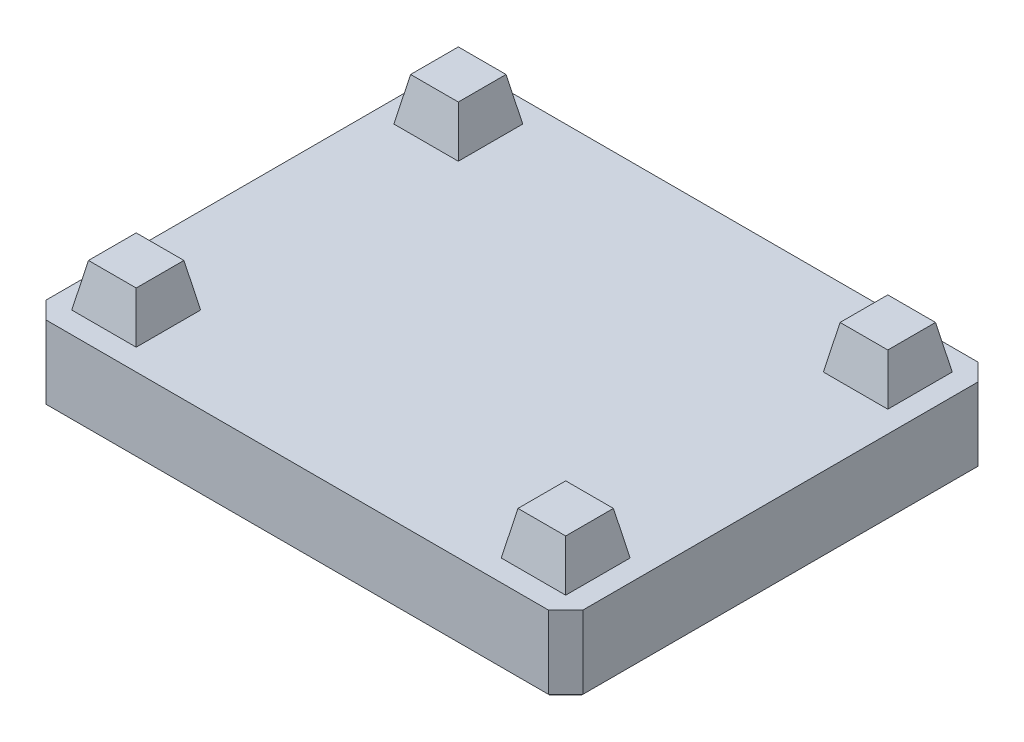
ISO-10303-21;
HEADER;
FILE_DESCRIPTION(('STEP AP214'),'2;1');
FILE_NAME('part.step','',(''),(''),'','','');
FILE_SCHEMA(('AUTOMOTIVE_DESIGN { 1 0 10303 214 1 1 1 1 }'));
ENDSEC;
DATA;
#1=APPLICATION_CONTEXT('core data for automotive mechanical design processes');
#2=APPLICATION_PROTOCOL_DEFINITION('international standard','automotive_design',2000,#1);
#3=PRODUCT_CONTEXT('',#1,'mechanical');
#4=PRODUCT('Part','Part','',(#3));
#5=PRODUCT_RELATED_PRODUCT_CATEGORY('part','',(#4));
#6=PRODUCT_DEFINITION_FORMATION('','',#4);
#7=PRODUCT_DEFINITION_CONTEXT('part definition',#1,'design');
#8=PRODUCT_DEFINITION('design','',#6,#7);
#9=PRODUCT_DEFINITION_SHAPE('','',#8);
#10=(LENGTH_UNIT() NAMED_UNIT(*) SI_UNIT(.MILLI.,.METRE.));
#11=(NAMED_UNIT(*) PLANE_ANGLE_UNIT() SI_UNIT($,.RADIAN.));
#12=(NAMED_UNIT(*) SI_UNIT($,.STERADIAN.) SOLID_ANGLE_UNIT());
#13=UNCERTAINTY_MEASURE_WITH_UNIT(LENGTH_MEASURE(1.E-05),#10,'distance_accuracy_value','');
#14=(GEOMETRIC_REPRESENTATION_CONTEXT(3) GLOBAL_UNCERTAINTY_ASSIGNED_CONTEXT((#13)) GLOBAL_UNIT_ASSIGNED_CONTEXT((#10,
#11,#12)) REPRESENTATION_CONTEXT('',''));
#15=CARTESIAN_POINT('',(0.,0.,0.));
#16=DIRECTION('',(0.,0.,1.));
#17=DIRECTION('',(1.,0.,0.));
#18=AXIS2_PLACEMENT_3D('',#15,#16,#17);
#19=CARTESIAN_POINT('',(0.,35.,200.));
#20=DIRECTION('',(0.,-1.,0.));
#21=DIRECTION('',(0.,0.,-1.));
#22=AXIS2_PLACEMENT_3D('',#19,#20,#21);
#23=PLANE('',#22);
#24=DIRECTION('',(0.,0.,-1.));
#25=VECTOR('',#24,1.);
#26=CARTESIAN_POINT('',(240.,35.,10.));
#27=LINE('',#26,#25);
#28=CARTESIAN_POINT('',(240.,35.,40.));
#29=VERTEX_POINT('',#28);
#30=CARTESIAN_POINT('',(240.,35.,10.));
#31=VERTEX_POINT('',#30);
#32=EDGE_CURVE('E244',#29,#31,#27,.T.);
#33=ORIENTED_EDGE('',*,*,#32,.F.);
#34=DIRECTION('',(1.,0.,0.));
#35=VECTOR('',#34,1.);
#36=CARTESIAN_POINT('',(240.,35.,40.));
#37=LINE('',#36,#35);
#38=CARTESIAN_POINT('',(210.,35.,40.));
#39=VERTEX_POINT('',#38);
#40=EDGE_CURVE('E257',#39,#29,#37,.T.);
#41=ORIENTED_EDGE('',*,*,#40,.F.);
#42=DIRECTION('',(0.,0.,1.));
#43=VECTOR('',#42,1.);
#44=CARTESIAN_POINT('',(210.,35.,10.));
#45=LINE('',#44,#43);
#46=CARTESIAN_POINT('',(210.,35.,9.99999999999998));
#47=VERTEX_POINT('',#46);
#48=EDGE_CURVE('E254',#47,#39,#45,.T.);
#49=ORIENTED_EDGE('',*,*,#48,.F.);
#50=DIRECTION('',(-1.,0.,0.));
#51=VECTOR('',#50,1.);
#52=CARTESIAN_POINT('',(240.,35.,10.));
#53=LINE('',#52,#51);
#54=EDGE_CURVE('E251',#31,#47,#53,.T.);
#55=ORIENTED_EDGE('',*,*,#54,.F.);
#56=EDGE_LOOP('',(#33,#41,#49,#55));
#57=FACE_BOUND('',#56,.T.);
#58=DIRECTION('',(-1.,0.,0.));
#59=VECTOR('',#58,1.);
#60=CARTESIAN_POINT('',(0.,35.,0.));
#61=LINE('',#60,#59);
#62=CARTESIAN_POINT('',(242.,35.,0.));
#63=VERTEX_POINT('',#62);
#64=CARTESIAN_POINT('',(8.00000000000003,35.,0.));
#65=VERTEX_POINT('',#64);
#66=EDGE_CURVE('E303',#63,#65,#61,.T.);
#67=ORIENTED_EDGE('',*,*,#66,.T.);
#68=DIRECTION('',(-0.707106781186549,0.,0.707106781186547));
#69=VECTOR('',#68,1.);
#70=CARTESIAN_POINT('',(0.,35.,8.00000000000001));
#71=LINE('',#70,#69);
#72=CARTESIAN_POINT('',(0.,35.,8.00000000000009));
#73=VERTEX_POINT('',#72);
#74=EDGE_CURVE('E331',#65,#73,#71,.T.);
#75=ORIENTED_EDGE('',*,*,#74,.T.);
#76=DIRECTION('',(0.,0.,-1.));
#77=VECTOR('',#76,1.);
#78=CARTESIAN_POINT('',(0.,35.,200.));
#79=LINE('',#78,#77);
#80=CARTESIAN_POINT('',(0.,35.,192.));
#81=VERTEX_POINT('',#80);
#82=EDGE_CURVE('E309',#81,#73,#79,.T.);
#83=ORIENTED_EDGE('',*,*,#82,.F.);
#84=DIRECTION('',(-0.707106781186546,0.,-0.707106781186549));
#85=VECTOR('',#84,1.);
#86=CARTESIAN_POINT('',(8.00000000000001,35.,200.));
#87=LINE('',#86,#85);
#88=CARTESIAN_POINT('',(8.00000000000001,35.,200.));
#89=VERTEX_POINT('',#88);
#90=EDGE_CURVE('E325',#81,#89,#87,.F.);
#91=ORIENTED_EDGE('',*,*,#90,.T.);
#92=DIRECTION('',(-1.,0.,0.));
#93=VECTOR('',#92,1.);
#94=CARTESIAN_POINT('',(0.,35.,200.));
#95=LINE('',#94,#93);
#96=CARTESIAN_POINT('',(242.,35.,200.));
#97=VERTEX_POINT('',#96);
#98=EDGE_CURVE('E306',#97,#89,#95,.T.);
#99=ORIENTED_EDGE('',*,*,#98,.F.);
#100=DIRECTION('',(-0.707106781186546,0.,0.707106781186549));
#101=VECTOR('',#100,1.);
#102=CARTESIAN_POINT('',(242.,35.,200.));
#103=LINE('',#102,#101);
#104=CARTESIAN_POINT('',(250.,35.,192.));
#105=VERTEX_POINT('',#104);
#106=EDGE_CURVE('E327',#97,#105,#103,.F.);
#107=ORIENTED_EDGE('',*,*,#106,.T.);
#108=DIRECTION('',(0.,0.,-1.));
#109=VECTOR('',#108,1.);
#110=CARTESIAN_POINT('',(250.,35.,200.));
#111=LINE('',#110,#109);
#112=CARTESIAN_POINT('',(250.,35.,8.00000000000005));
#113=VERTEX_POINT('',#112);
#114=EDGE_CURVE('E312',#105,#113,#111,.T.);
#115=ORIENTED_EDGE('',*,*,#114,.T.);
#116=DIRECTION('',(-0.707106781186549,0.,-0.707106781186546));
#117=VECTOR('',#116,1.);
#118=CARTESIAN_POINT('',(250.,35.,8.00000000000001));
#119=LINE('',#118,#117);
#120=EDGE_CURVE('E329',#113,#63,#119,.T.);
#121=ORIENTED_EDGE('',*,*,#120,.T.);
#122=EDGE_LOOP('',(#67,#75,#83,#91,#99,#107,#115,#121));
#123=FACE_BOUND('',#122,.T.);
#124=DIRECTION('',(0.,0.,-1.));
#125=VECTOR('',#124,1.);
#126=CARTESIAN_POINT('',(240.,35.,160.));
#127=LINE('',#126,#125);
#128=CARTESIAN_POINT('',(240.,35.,190.));
#129=VERTEX_POINT('',#128);
#130=CARTESIAN_POINT('',(240.,35.,160.));
#131=VERTEX_POINT('',#130);
#132=EDGE_CURVE('E241',#129,#131,#127,.T.);
#133=ORIENTED_EDGE('',*,*,#132,.F.);
#134=DIRECTION('',(1.,0.,0.));
#135=VECTOR('',#134,1.);
#136=CARTESIAN_POINT('',(240.,35.,190.));
#137=LINE('',#136,#135);
#138=CARTESIAN_POINT('',(210.,35.,190.));
#139=VERTEX_POINT('',#138);
#140=EDGE_CURVE('E227',#139,#129,#137,.T.);
#141=ORIENTED_EDGE('',*,*,#140,.F.);
#142=DIRECTION('',(0.,0.,1.));
#143=VECTOR('',#142,1.);
#144=CARTESIAN_POINT('',(210.,35.,160.));
#145=LINE('',#144,#143);
#146=CARTESIAN_POINT('',(210.,35.,160.));
#147=VERTEX_POINT('',#146);
#148=EDGE_CURVE('E861',#147,#139,#145,.T.);
#149=ORIENTED_EDGE('',*,*,#148,.F.);
#150=DIRECTION('',(-1.,0.,0.));
#151=VECTOR('',#150,1.);
#152=CARTESIAN_POINT('',(240.,35.,160.));
#153=LINE('',#152,#151);
#154=EDGE_CURVE('E242',#131,#147,#153,.T.);
#155=ORIENTED_EDGE('',*,*,#154,.F.);
#156=EDGE_LOOP('',(#133,#141,#149,#155));
#157=FACE_BOUND('',#156,.T.);
#158=DIRECTION('',(0.,0.,-1.));
#159=VECTOR('',#158,1.);
#160=CARTESIAN_POINT('',(40.,35.,10.));
#161=LINE('',#160,#159);
#162=CARTESIAN_POINT('',(40.,35.,40.));
#163=VERTEX_POINT('',#162);
#164=CARTESIAN_POINT('',(40.,35.,10.));
#165=VERTEX_POINT('',#164);
#166=EDGE_CURVE('E377',#163,#165,#161,.T.);
#167=ORIENTED_EDGE('',*,*,#166,.F.);
#168=DIRECTION('',(1.,0.,0.));
#169=VECTOR('',#168,1.);
#170=CARTESIAN_POINT('',(40.,35.,40.));
#171=LINE('',#170,#169);
#172=CARTESIAN_POINT('',(9.99999999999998,35.,40.));
#173=VERTEX_POINT('',#172);
#174=EDGE_CURVE('E379',#173,#163,#171,.T.);
#175=ORIENTED_EDGE('',*,*,#174,.F.);
#176=DIRECTION('',(0.,0.,1.));
#177=VECTOR('',#176,1.);
#178=CARTESIAN_POINT('',(9.99999999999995,35.,10.));
#179=LINE('',#178,#177);
#180=CARTESIAN_POINT('',(9.99999999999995,35.,9.99999999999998));
#181=VERTEX_POINT('',#180);
#182=EDGE_CURVE('E382',#181,#173,#179,.T.);
#183=ORIENTED_EDGE('',*,*,#182,.F.);
#184=DIRECTION('',(-1.,0.,0.));
#185=VECTOR('',#184,1.);
#186=CARTESIAN_POINT('',(40.,35.,10.));
#187=LINE('',#186,#185);
#188=EDGE_CURVE('E385',#165,#181,#187,.T.);
#189=ORIENTED_EDGE('',*,*,#188,.F.);
#190=EDGE_LOOP('',(#167,#175,#183,#189));
#191=FACE_BOUND('',#190,.T.);
#192=DIRECTION('',(0.,0.,-1.));
#193=VECTOR('',#192,1.);
#194=CARTESIAN_POINT('',(40.,35.,160.));
#195=LINE('',#194,#193);
#196=CARTESIAN_POINT('',(40.,35.,190.));
#197=VERTEX_POINT('',#196);
#198=CARTESIAN_POINT('',(40.,35.,160.));
#199=VERTEX_POINT('',#198);
#200=EDGE_CURVE('E412',#197,#199,#195,.T.);
#201=ORIENTED_EDGE('',*,*,#200,.F.);
#202=DIRECTION('',(1.,0.,0.));
#203=VECTOR('',#202,1.);
#204=CARTESIAN_POINT('',(40.,35.,190.));
#205=LINE('',#204,#203);
#206=CARTESIAN_POINT('',(9.99999999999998,35.,190.));
#207=VERTEX_POINT('',#206);
#208=EDGE_CURVE('E414',#207,#197,#205,.T.);
#209=ORIENTED_EDGE('',*,*,#208,.F.);
#210=DIRECTION('',(0.,0.,1.));
#211=VECTOR('',#210,1.);
#212=CARTESIAN_POINT('',(9.99999999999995,35.,160.));
#213=LINE('',#212,#211);
#214=CARTESIAN_POINT('',(9.99999999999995,35.,160.));
#215=VERTEX_POINT('',#214);
#216=EDGE_CURVE('E417',#215,#207,#213,.T.);
#217=ORIENTED_EDGE('',*,*,#216,.F.);
#218=DIRECTION('',(-1.,0.,0.));
#219=VECTOR('',#218,1.);
#220=CARTESIAN_POINT('',(40.,35.,160.));
#221=LINE('',#220,#219);
#222=EDGE_CURVE('E419',#199,#215,#221,.T.);
#223=ORIENTED_EDGE('',*,*,#222,.F.);
#224=EDGE_LOOP('',(#201,#209,#217,#223));
#225=FACE_BOUND('',#224,.T.);
#226=ADVANCED_FACE('F28',(#57,#123,#157,#191,#225),#23,.F.);
#227=CARTESIAN_POINT('',(0.,0.,200.));
#228=DIRECTION('',(1.,0.,0.));
#229=DIRECTION('',(0.,0.,-1.));
#230=AXIS2_PLACEMENT_3D('',#227,#228,#229);
#231=PLANE('',#230);
#232=DIRECTION('',(0.,-1.,0.));
#233=VECTOR('',#232,1.);
#234=CARTESIAN_POINT('',(0.,0.,8.00000000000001));
#235=LINE('',#234,#233);
#236=CARTESIAN_POINT('',(0.,1.,8.00000000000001));
#237=VERTEX_POINT('',#236);
#238=EDGE_CURVE('E317',#73,#237,#235,.T.);
#239=ORIENTED_EDGE('',*,*,#238,.T.);
#240=DIRECTION('',(0.,0.,1.));
#241=VECTOR('',#240,1.);
#242=CARTESIAN_POINT('',(0.,1.,200.));
#243=LINE('',#242,#241);
#244=CARTESIAN_POINT('',(0.,1.,192.));
#245=VERTEX_POINT('',#244);
#246=EDGE_CURVE('E375',#237,#245,#243,.T.);
#247=ORIENTED_EDGE('',*,*,#246,.T.);
#248=DIRECTION('',(0.,1.,0.));
#249=VECTOR('',#248,1.);
#250=CARTESIAN_POINT('',(0.,0.,192.));
#251=LINE('',#250,#249);
#252=EDGE_CURVE('E315',#245,#81,#251,.T.);
#253=ORIENTED_EDGE('',*,*,#252,.T.);
#254=ORIENTED_EDGE('',*,*,#82,.T.);
#255=EDGE_LOOP('',(#239,#247,#253,#254));
#256=FACE_BOUND('',#255,.T.);
#257=ADVANCED_FACE('F445',(#256),#231,.F.);
#258=CARTESIAN_POINT('',(0.,0.,200.));
#259=DIRECTION('',(0.,1.,0.));
#260=DIRECTION('',(0.,0.,1.));
#261=AXIS2_PLACEMENT_3D('',#258,#259,#260);
#262=PLANE('',#261);
#263=DIRECTION('',(-1.,0.,0.));
#264=VECTOR('',#263,1.);
#265=CARTESIAN_POINT('',(0.,0.,199.));
#266=LINE('',#265,#264);
#267=CARTESIAN_POINT('',(241.585786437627,0.,199.));
#268=VERTEX_POINT('',#267);
#269=CARTESIAN_POINT('',(8.4142135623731,0.,199.));
#270=VERTEX_POINT('',#269);
#271=EDGE_CURVE('E355',#268,#270,#266,.T.);
#272=ORIENTED_EDGE('',*,*,#271,.T.);
#273=DIRECTION('',(-0.707106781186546,0.,-0.707106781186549));
#274=VECTOR('',#273,1.);
#275=CARTESIAN_POINT('',(0.707106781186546,0.,191.292893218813));
#276=LINE('',#275,#274);
#277=CARTESIAN_POINT('',(1.,0.,191.585786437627));
#278=VERTEX_POINT('',#277);
#279=EDGE_CURVE('E357',#270,#278,#276,.T.);
#280=ORIENTED_EDGE('',*,*,#279,.T.);
#281=DIRECTION('',(0.,0.,-1.));
#282=VECTOR('',#281,1.);
#283=CARTESIAN_POINT('',(1.,0.,200.));
#284=LINE('',#283,#282);
#285=CARTESIAN_POINT('',(1.,0.,8.41421356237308));
#286=VERTEX_POINT('',#285);
#287=EDGE_CURVE('E343',#278,#286,#284,.T.);
#288=ORIENTED_EDGE('',*,*,#287,.T.);
#289=DIRECTION('',(0.707106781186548,0.,-0.707106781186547));
#290=VECTOR('',#289,1.);
#291=CARTESIAN_POINT('',(8.70710678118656,0.,0.707106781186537));
#292=LINE('',#291,#290);
#293=CARTESIAN_POINT('',(8.4142135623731,0.,1.));
#294=VERTEX_POINT('',#293);
#295=EDGE_CURVE('E345',#286,#294,#292,.T.);
#296=ORIENTED_EDGE('',*,*,#295,.T.);
#297=DIRECTION('',(1.,0.,0.));
#298=VECTOR('',#297,1.);
#299=CARTESIAN_POINT('',(242.,0.,1.));
#300=LINE('',#299,#298);
#301=CARTESIAN_POINT('',(241.585786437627,0.,1.));
#302=VERTEX_POINT('',#301);
#303=EDGE_CURVE('E347',#294,#302,#300,.T.);
#304=ORIENTED_EDGE('',*,*,#303,.T.);
#305=DIRECTION('',(0.707106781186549,0.,0.707106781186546));
#306=VECTOR('',#305,1.);
#307=CARTESIAN_POINT('',(249.292893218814,0.,8.70710678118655));
#308=LINE('',#307,#306);
#309=CARTESIAN_POINT('',(249.,0.,8.41421356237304));
#310=VERTEX_POINT('',#309);
#311=EDGE_CURVE('E349',#302,#310,#308,.T.);
#312=ORIENTED_EDGE('',*,*,#311,.T.);
#313=DIRECTION('',(0.,0.,1.));
#314=VECTOR('',#313,1.);
#315=CARTESIAN_POINT('',(249.,0.,200.));
#316=LINE('',#315,#314);
#317=CARTESIAN_POINT('',(249.,0.,191.585786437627));
#318=VERTEX_POINT('',#317);
#319=EDGE_CURVE('E351',#310,#318,#316,.T.);
#320=ORIENTED_EDGE('',*,*,#319,.T.);
#321=DIRECTION('',(-0.707106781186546,0.,0.707106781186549));
#322=VECTOR('',#321,1.);
#323=CARTESIAN_POINT('',(241.292893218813,0.,199.292893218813));
#324=LINE('',#323,#322);
#325=EDGE_CURVE('E353',#318,#268,#324,.T.);
#326=ORIENTED_EDGE('',*,*,#325,.T.);
#327=EDGE_LOOP('',(#272,#280,#288,#296,#304,#312,#320,#326));
#328=FACE_BOUND('',#327,.T.);
#329=ADVANCED_FACE('F451',(#328),#262,.F.);
#330=CARTESIAN_POINT('',(250.,0.,200.));
#331=DIRECTION('',(-1.,0.,0.));
#332=DIRECTION('',(0.,0.,1.));
#333=AXIS2_PLACEMENT_3D('',#330,#331,#332);
#334=PLANE('',#333);
#335=DIRECTION('',(0.,-1.,0.));
#336=VECTOR('',#335,1.);
#337=CARTESIAN_POINT('',(250.,0.,192.));
#338=LINE('',#337,#336);
#339=CARTESIAN_POINT('',(250.,1.,192.));
#340=VERTEX_POINT('',#339);
#341=EDGE_CURVE('E333',#105,#340,#338,.T.);
#342=ORIENTED_EDGE('',*,*,#341,.T.);
#343=DIRECTION('',(0.,0.,-1.));
#344=VECTOR('',#343,1.);
#345=CARTESIAN_POINT('',(250.,1.,200.));
#346=LINE('',#345,#344);
#347=CARTESIAN_POINT('',(250.,1.,8.00000000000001));
#348=VERTEX_POINT('',#347);
#349=EDGE_CURVE('E367',#340,#348,#346,.T.);
#350=ORIENTED_EDGE('',*,*,#349,.T.);
#351=DIRECTION('',(0.,1.,0.));
#352=VECTOR('',#351,1.);
#353=CARTESIAN_POINT('',(250.,35.,8.00000000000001));
#354=LINE('',#353,#352);
#355=EDGE_CURVE('E336',#348,#113,#354,.T.);
#356=ORIENTED_EDGE('',*,*,#355,.T.);
#357=ORIENTED_EDGE('',*,*,#114,.F.);
#358=EDGE_LOOP('',(#342,#350,#356,#357));
#359=FACE_BOUND('',#358,.T.);
#360=ADVANCED_FACE('F459',(#359),#334,.F.);
#361=CARTESIAN_POINT('',(0.,35.,200.));
#362=DIRECTION('',(0.,0.,-1.));
#363=DIRECTION('',(-1.,0.,0.));
#364=AXIS2_PLACEMENT_3D('',#361,#362,#363);
#365=PLANE('',#364);
#366=DIRECTION('',(0.,-1.,0.));
#367=VECTOR('',#366,1.);
#368=CARTESIAN_POINT('',(8.00000000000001,35.,200.));
#369=LINE('',#368,#367);
#370=CARTESIAN_POINT('',(8.00000000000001,1.,200.));
#371=VERTEX_POINT('',#370);
#372=EDGE_CURVE('E338',#89,#371,#369,.T.);
#373=ORIENTED_EDGE('',*,*,#372,.T.);
#374=DIRECTION('',(1.,0.,0.));
#375=VECTOR('',#374,1.);
#376=CARTESIAN_POINT('',(0.,1.,200.));
#377=LINE('',#376,#375);
#378=CARTESIAN_POINT('',(242.,1.,200.));
#379=VERTEX_POINT('',#378);
#380=EDGE_CURVE('E363',#371,#379,#377,.T.);
#381=ORIENTED_EDGE('',*,*,#380,.T.);
#382=DIRECTION('',(0.,1.,0.));
#383=VECTOR('',#382,1.);
#384=CARTESIAN_POINT('',(242.,35.,200.));
#385=LINE('',#384,#383);
#386=EDGE_CURVE('E341',#379,#97,#385,.T.);
#387=ORIENTED_EDGE('',*,*,#386,.T.);
#388=ORIENTED_EDGE('',*,*,#98,.T.);
#389=EDGE_LOOP('',(#373,#381,#387,#388));
#390=FACE_BOUND('',#389,.T.);
#391=ADVANCED_FACE('F457',(#390),#365,.F.);
#392=CARTESIAN_POINT('',(0.,35.,0.));
#393=DIRECTION('',(0.,0.,-1.));
#394=DIRECTION('',(-1.,0.,0.));
#395=AXIS2_PLACEMENT_3D('',#392,#393,#394);
#396=PLANE('',#395);
#397=DIRECTION('',(0.,-1.,0.));
#398=VECTOR('',#397,1.);
#399=CARTESIAN_POINT('',(242.,0.,0.));
#400=LINE('',#399,#398);
#401=CARTESIAN_POINT('',(242.,1.,0.));
#402=VERTEX_POINT('',#401);
#403=EDGE_CURVE('E320',#63,#402,#400,.T.);
#404=ORIENTED_EDGE('',*,*,#403,.T.);
#405=DIRECTION('',(-1.,0.,0.));
#406=VECTOR('',#405,1.);
#407=CARTESIAN_POINT('',(8.00000000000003,1.,0.));
#408=LINE('',#407,#406);
#409=CARTESIAN_POINT('',(8.00000000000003,1.,0.));
#410=VERTEX_POINT('',#409);
#411=EDGE_CURVE('E371',#402,#410,#408,.T.);
#412=ORIENTED_EDGE('',*,*,#411,.T.);
#413=DIRECTION('',(0.,1.,0.));
#414=VECTOR('',#413,1.);
#415=CARTESIAN_POINT('',(8.00000000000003,35.,0.));
#416=LINE('',#415,#414);
#417=EDGE_CURVE('E323',#410,#65,#416,.T.);
#418=ORIENTED_EDGE('',*,*,#417,.T.);
#419=ORIENTED_EDGE('',*,*,#66,.F.);
#420=EDGE_LOOP('',(#404,#412,#418,#419));
#421=FACE_BOUND('',#420,.T.);
#422=ADVANCED_FACE('F686',(#421),#396,.T.);
#423=CARTESIAN_POINT('',(0.,0.,8.00000000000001));
#424=DIRECTION('',(-0.707106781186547,0.,-0.707106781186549));
#425=DIRECTION('',(-0.707106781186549,0.,0.707106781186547));
#426=AXIS2_PLACEMENT_3D('',#423,#424,#425);
#427=PLANE('',#426);
#428=ORIENTED_EDGE('',*,*,#417,.F.);
#429=DIRECTION('',(-0.707106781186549,0.,0.707106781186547));
#430=VECTOR('',#429,1.);
#431=CARTESIAN_POINT('',(0.,1.00000000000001,8.00000000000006));
#432=LINE('',#431,#430);
#433=EDGE_CURVE('E373',#410,#237,#432,.T.);
#434=ORIENTED_EDGE('',*,*,#433,.T.);
#435=ORIENTED_EDGE('',*,*,#238,.F.);
#436=ORIENTED_EDGE('',*,*,#74,.F.);
#437=EDGE_LOOP('',(#428,#434,#435,#436));
#438=FACE_BOUND('',#437,.T.);
#439=ADVANCED_FACE('F678',(#438),#427,.T.);
#440=CARTESIAN_POINT('',(250.,0.,8.00000000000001));
#441=DIRECTION('',(0.707106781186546,0.,-0.707106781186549));
#442=DIRECTION('',(-0.707106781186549,0.,-0.707106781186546));
#443=AXIS2_PLACEMENT_3D('',#440,#441,#442);
#444=PLANE('',#443);
#445=ORIENTED_EDGE('',*,*,#355,.F.);
#446=DIRECTION('',(-0.707106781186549,0.,-0.707106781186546));
#447=VECTOR('',#446,1.);
#448=CARTESIAN_POINT('',(242.,1.,0.));
#449=LINE('',#448,#447);
#450=EDGE_CURVE('E369',#348,#402,#449,.T.);
#451=ORIENTED_EDGE('',*,*,#450,.T.);
#452=ORIENTED_EDGE('',*,*,#403,.F.);
#453=ORIENTED_EDGE('',*,*,#120,.F.);
#454=EDGE_LOOP('',(#445,#451,#452,#453));
#455=FACE_BOUND('',#454,.T.);
#456=ADVANCED_FACE('F670',(#455),#444,.T.);
#457=CARTESIAN_POINT('',(242.,35.,200.));
#458=DIRECTION('',(-0.707106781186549,0.,-0.707106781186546));
#459=DIRECTION('',(-0.707106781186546,0.,0.707106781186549));
#460=AXIS2_PLACEMENT_3D('',#457,#458,#459);
#461=PLANE('',#460);
#462=ORIENTED_EDGE('',*,*,#386,.F.);
#463=DIRECTION('',(-0.707106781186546,0.,0.707106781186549));
#464=VECTOR('',#463,1.);
#465=CARTESIAN_POINT('',(250.,1.00000000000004,192.));
#466=LINE('',#465,#464);
#467=EDGE_CURVE('E365',#379,#340,#466,.F.);
#468=ORIENTED_EDGE('',*,*,#467,.T.);
#469=ORIENTED_EDGE('',*,*,#341,.F.);
#470=ORIENTED_EDGE('',*,*,#106,.F.);
#471=EDGE_LOOP('',(#462,#468,#469,#470));
#472=FACE_BOUND('',#471,.T.);
#473=ADVANCED_FACE('F662',(#472),#461,.F.);
#474=CARTESIAN_POINT('',(8.00000000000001,35.,200.));
#475=DIRECTION('',(0.707106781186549,0.,-0.707106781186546));
#476=DIRECTION('',(-0.707106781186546,0.,-0.707106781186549));
#477=AXIS2_PLACEMENT_3D('',#474,#475,#476);
#478=PLANE('',#477);
#479=ORIENTED_EDGE('',*,*,#252,.F.);
#480=DIRECTION('',(-0.707106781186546,0.,-0.707106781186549));
#481=VECTOR('',#480,1.);
#482=CARTESIAN_POINT('',(8.00000000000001,1.,200.));
#483=LINE('',#482,#481);
#484=EDGE_CURVE('E360',#245,#371,#483,.F.);
#485=ORIENTED_EDGE('',*,*,#484,.T.);
#486=ORIENTED_EDGE('',*,*,#372,.F.);
#487=ORIENTED_EDGE('',*,*,#90,.F.);
#488=EDGE_LOOP('',(#479,#485,#486,#487));
#489=FACE_BOUND('',#488,.T.);
#490=ADVANCED_FACE('F654',(#489),#478,.F.);
#491=CARTESIAN_POINT('',(220.292893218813,0.,-20.2928932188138));
#492=DIRECTION('',(0.500000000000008,-0.707106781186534,-0.50000000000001));
#493=DIRECTION('',(0.,0.577350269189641,-0.816496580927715));
#494=AXIS2_PLACEMENT_3D('',#491,#492,#493);
#495=PLANE('',#494);
#496=DIRECTION('',(-0.281084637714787,-0.678598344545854,0.678598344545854));
#497=VECTOR('',#496,1.);
#498=CARTESIAN_POINT('',(222.498438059,-46.0809353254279,47.0809353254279));
#499=LINE('',#498,#497);
#500=EDGE_CURVE('E297',#402,#302,#499,.T.);
#501=ORIENTED_EDGE('',*,*,#500,.F.);
#502=ORIENTED_EDGE('',*,*,#450,.F.);
#503=DIRECTION('',(0.678598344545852,0.678598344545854,-0.28108463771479));
#504=VECTOR('',#503,1.);
#505=CARTESIAN_POINT('',(241.256196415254,-7.74380358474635,11.621802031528));
#506=LINE('',#505,#504);
#507=EDGE_CURVE('E300',#310,#348,#506,.T.);
#508=ORIENTED_EDGE('',*,*,#507,.F.);
#509=ORIENTED_EDGE('',*,*,#311,.F.);
#510=EDGE_LOOP('',(#501,#502,#508,#509));
#511=FACE_BOUND('',#510,.T.);
#512=ADVANCED_FACE('F646',(#511),#495,.T.);
#513=CARTESIAN_POINT('',(250.,1.,200.));
#514=DIRECTION('',(-0.707106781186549,0.707106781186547,0.));
#515=DIRECTION('',(-0.707106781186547,-0.707106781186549,0.));
#516=AXIS2_PLACEMENT_3D('',#513,#514,#515);
#517=PLANE('',#516);
#518=ORIENTED_EDGE('',*,*,#507,.T.);
#519=ORIENTED_EDGE('',*,*,#349,.F.);
#520=DIRECTION('',(-0.678598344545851,-0.678598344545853,-0.281084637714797));
#521=VECTOR('',#520,1.);
#522=CARTESIAN_POINT('',(251.525948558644,2.52594855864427,192.632068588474));
#523=LINE('',#522,#521);
#524=EDGE_CURVE('E294',#318,#340,#523,.F.);
#525=ORIENTED_EDGE('',*,*,#524,.F.);
#526=ORIENTED_EDGE('',*,*,#319,.F.);
#527=EDGE_LOOP('',(#518,#519,#525,#526));
#528=FACE_BOUND('',#527,.T.);
#529=ADVANCED_FACE('F638',(#528),#517,.F.);
#530=CARTESIAN_POINT('',(0.,0.,1.));
#531=DIRECTION('',(0.,-0.707106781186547,-0.707106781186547));
#532=DIRECTION('',(0.,0.707106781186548,-0.707106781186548));
#533=AXIS2_PLACEMENT_3D('',#530,#531,#532);
#534=PLANE('',#533);
#535=ORIENTED_EDGE('',*,*,#500,.T.);
#536=ORIENTED_EDGE('',*,*,#303,.F.);
#537=DIRECTION('',(0.281084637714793,-0.678598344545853,0.678598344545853));
#538=VECTOR('',#537,1.);
#539=CARTESIAN_POINT('',(20.0019267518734,-27.9752143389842,28.9752143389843));
#540=LINE('',#539,#538);
#541=EDGE_CURVE('E291',#410,#294,#540,.T.);
#542=ORIENTED_EDGE('',*,*,#541,.F.);
#543=ORIENTED_EDGE('',*,*,#411,.F.);
#544=EDGE_LOOP('',(#535,#536,#542,#543));
#545=FACE_BOUND('',#544,.T.);
#546=ADVANCED_FACE('F630',(#545),#534,.T.);
#547=CARTESIAN_POINT('',(120.292893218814,0.,320.292893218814));
#548=DIRECTION('',(-0.500000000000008,0.707106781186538,-0.500000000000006));
#549=DIRECTION('',(-0.816496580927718,-0.577350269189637,0.));
#550=AXIS2_PLACEMENT_3D('',#547,#548,#549);
#551=PLANE('',#550);
#552=ORIENTED_EDGE('',*,*,#524,.T.);
#553=ORIENTED_EDGE('',*,*,#467,.F.);
#554=DIRECTION('',(-0.281084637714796,-0.678598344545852,-0.678598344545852));
#555=VECTOR('',#554,1.);
#556=CARTESIAN_POINT('',(255.138447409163,32.7190179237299,231.71901792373));
#557=LINE('',#556,#555);
#558=EDGE_CURVE('E288',#268,#379,#557,.F.);
#559=ORIENTED_EDGE('',*,*,#558,.F.);
#560=ORIENTED_EDGE('',*,*,#325,.F.);
#561=EDGE_LOOP('',(#552,#553,#559,#560));
#562=FACE_BOUND('',#561,.T.);
#563=ADVANCED_FACE('F622',(#562),#551,.F.);
#564=CARTESIAN_POINT('',(-95.2928932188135,0.,104.707106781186));
#565=DIRECTION('',(-0.500000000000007,-0.707106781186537,-0.500000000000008));
#566=DIRECTION('',(0.,0.577350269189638,-0.816496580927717));
#567=AXIS2_PLACEMENT_3D('',#564,#565,#566);
#568=PLANE('',#567);
#569=ORIENTED_EDGE('',*,*,#541,.T.);
#570=ORIENTED_EDGE('',*,*,#295,.F.);
#571=DIRECTION('',(-0.678598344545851,0.678598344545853,-0.281084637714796));
#572=VECTOR('',#571,1.);
#573=CARTESIAN_POINT('',(37.5437568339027,-36.5437568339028,23.5511332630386));
#574=LINE('',#573,#572);
#575=EDGE_CURVE('E285',#237,#286,#574,.F.);
#576=ORIENTED_EDGE('',*,*,#575,.F.);
#577=ORIENTED_EDGE('',*,*,#433,.F.);
#578=EDGE_LOOP('',(#569,#570,#576,#577));
#579=FACE_BOUND('',#578,.T.);
#580=ADVANCED_FACE('F614',(#579),#568,.T.);
#581=CARTESIAN_POINT('',(0.,1.,200.));
#582=DIRECTION('',(0.,0.707106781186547,-0.707106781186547));
#583=DIRECTION('',(0.,0.707106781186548,0.707106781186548));
#584=AXIS2_PLACEMENT_3D('',#581,#582,#583);
#585=PLANE('',#584);
#586=ORIENTED_EDGE('',*,*,#558,.T.);
#587=ORIENTED_EDGE('',*,*,#380,.F.);
#588=DIRECTION('',(0.281084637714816,-0.678598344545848,-0.678598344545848));
#589=VECTOR('',#588,1.);
#590=CARTESIAN_POINT('',(7.36793141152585,2.52594855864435,201.525948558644));
#591=LINE('',#590,#589);
#592=EDGE_CURVE('E283',#270,#371,#591,.F.);
#593=ORIENTED_EDGE('',*,*,#592,.F.);
#594=ORIENTED_EDGE('',*,*,#271,.F.);
#595=EDGE_LOOP('',(#586,#587,#593,#594));
#596=FACE_BOUND('',#595,.T.);
#597=ADVANCED_FACE('F606',(#596),#585,.F.);
#598=CARTESIAN_POINT('',(1.,0.,200.));
#599=DIRECTION('',(0.707106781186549,0.707106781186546,0.));
#600=DIRECTION('',(-0.707106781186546,0.707106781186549,0.));
#601=AXIS2_PLACEMENT_3D('',#598,#599,#600);
#602=PLANE('',#601);
#603=ORIENTED_EDGE('',*,*,#575,.T.);
#604=ORIENTED_EDGE('',*,*,#287,.F.);
#605=DIRECTION('',(-0.678598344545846,0.678598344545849,0.281084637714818));
#606=VECTOR('',#605,1.);
#607=CARTESIAN_POINT('',(-0.604957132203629,1.60495713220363,192.250581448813));
#608=LINE('',#607,#606);
#609=EDGE_CURVE('E264',#245,#278,#608,.F.);
#610=ORIENTED_EDGE('',*,*,#609,.F.);
#611=ORIENTED_EDGE('',*,*,#246,.F.);
#612=EDGE_LOOP('',(#603,#604,#610,#611));
#613=FACE_BOUND('',#612,.T.);
#614=ADVANCED_FACE('F598',(#613),#602,.F.);
#615=CARTESIAN_POINT('',(4.70710678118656,0.,195.292893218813));
#616=DIRECTION('',(0.500000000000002,0.707106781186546,-0.5));
#617=DIRECTION('',(-0.816496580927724,0.577350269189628,0.));
#618=AXIS2_PLACEMENT_3D('',#615,#616,#617);
#619=PLANE('',#618);
#620=ORIENTED_EDGE('',*,*,#592,.T.);
#621=ORIENTED_EDGE('',*,*,#484,.F.);
#622=ORIENTED_EDGE('',*,*,#609,.T.);
#623=ORIENTED_EDGE('',*,*,#279,.F.);
#624=EDGE_LOOP('',(#620,#621,#622,#623));
#625=FACE_BOUND('',#624,.T.);
#626=ADVANCED_FACE('F590',(#625),#619,.F.);
#627=CARTESIAN_POINT('',(240.,35.,10.));
#628=DIRECTION('',(0.981627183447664,0.190808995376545,0.));
#629=DIRECTION('',(-0.190808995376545,0.981627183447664,0.));
#630=AXIS2_PLACEMENT_3D('',#627,#628,#629);
#631=PLANE('',#630);
#632=ORIENTED_EDGE('',*,*,#32,.T.);
#633=DIRECTION('',(0.187427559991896,-0.964231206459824,-0.187427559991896));
#634=VECTOR('',#633,1.);
#635=CARTESIAN_POINT('',(240.,35.,10.));
#636=LINE('',#635,#634);
#637=CARTESIAN_POINT('',(236.112393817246,55.,13.8876061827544));
#638=VERTEX_POINT('',#637);
#639=EDGE_CURVE('E261',#638,#31,#636,.T.);
#640=ORIENTED_EDGE('',*,*,#639,.F.);
#641=DIRECTION('',(0.,0.,1.));
#642=VECTOR('',#641,1.);
#643=CARTESIAN_POINT('',(236.112393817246,55.,40.));
#644=LINE('',#643,#642);
#645=CARTESIAN_POINT('',(236.112393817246,55.,36.1123938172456));
#646=VERTEX_POINT('',#645);
#647=EDGE_CURVE('E260',#646,#638,#644,.F.);
#648=ORIENTED_EDGE('',*,*,#647,.F.);
#649=DIRECTION('',(0.187427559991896,-0.964231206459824,0.187427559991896));
#650=VECTOR('',#649,1.);
#651=CARTESIAN_POINT('',(238.946127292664,40.4217050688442,38.9461272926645));
#652=LINE('',#651,#650);
#653=EDGE_CURVE('E266',#646,#29,#652,.T.);
#654=ORIENTED_EDGE('',*,*,#653,.T.);
#655=EDGE_LOOP('',(#632,#640,#648,#654));
#656=FACE_BOUND('',#655,.T.);
#657=ADVANCED_FACE('F582',(#656),#631,.T.);
#658=CARTESIAN_POINT('',(240.,35.,10.));
#659=DIRECTION('',(0.,0.190808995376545,-0.981627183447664));
#660=DIRECTION('',(0.,0.981627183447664,0.190808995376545));
#661=AXIS2_PLACEMENT_3D('',#658,#659,#660);
#662=PLANE('',#661);
#663=ORIENTED_EDGE('',*,*,#54,.T.);
#664=DIRECTION('',(-0.187427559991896,-0.964231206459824,-0.187427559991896));
#665=VECTOR('',#664,1.);
#666=CARTESIAN_POINT('',(210.,35.,10.));
#667=LINE('',#666,#665);
#668=CARTESIAN_POINT('',(213.887606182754,55.,13.8876061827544));
#669=VERTEX_POINT('',#668);
#670=EDGE_CURVE('E265',#669,#47,#667,.T.);
#671=ORIENTED_EDGE('',*,*,#670,.F.);
#672=DIRECTION('',(1.,0.,0.));
#673=VECTOR('',#672,1.);
#674=CARTESIAN_POINT('',(240.,55.,13.8876061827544));
#675=LINE('',#674,#673);
#676=EDGE_CURVE('E277',#638,#669,#675,.F.);
#677=ORIENTED_EDGE('',*,*,#676,.F.);
#678=ORIENTED_EDGE('',*,*,#639,.T.);
#679=EDGE_LOOP('',(#663,#671,#677,#678));
#680=FACE_BOUND('',#679,.T.);
#681=ADVANCED_FACE('F574',(#680),#662,.T.);
#682=CARTESIAN_POINT('',(210.,35.,10.));
#683=DIRECTION('',(-0.981627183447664,0.190808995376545,0.));
#684=DIRECTION('',(-0.190808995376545,-0.981627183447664,0.));
#685=AXIS2_PLACEMENT_3D('',#682,#683,#684);
#686=PLANE('',#685);
#687=ORIENTED_EDGE('',*,*,#48,.T.);
#688=DIRECTION('',(-0.187427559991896,-0.964231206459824,0.187427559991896));
#689=VECTOR('',#688,1.);
#690=CARTESIAN_POINT('',(211.053872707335,40.4217050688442,38.9461272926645));
#691=LINE('',#690,#689);
#692=CARTESIAN_POINT('',(213.887606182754,55.,36.1123938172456));
#693=VERTEX_POINT('',#692);
#694=EDGE_CURVE('E269',#693,#39,#691,.T.);
#695=ORIENTED_EDGE('',*,*,#694,.F.);
#696=DIRECTION('',(0.,0.,-1.));
#697=VECTOR('',#696,1.);
#698=CARTESIAN_POINT('',(213.887606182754,55.,40.));
#699=LINE('',#698,#697);
#700=EDGE_CURVE('E279',#669,#693,#699,.F.);
#701=ORIENTED_EDGE('',*,*,#700,.F.);
#702=ORIENTED_EDGE('',*,*,#670,.T.);
#703=EDGE_LOOP('',(#687,#695,#701,#702));
#704=FACE_BOUND('',#703,.T.);
#705=ADVANCED_FACE('F566',(#704),#686,.T.);
#706=CARTESIAN_POINT('',(240.,35.,40.));
#707=DIRECTION('',(0.,0.190808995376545,0.981627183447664));
#708=DIRECTION('',(0.,-0.981627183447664,0.190808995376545));
#709=AXIS2_PLACEMENT_3D('',#706,#707,#708);
#710=PLANE('',#709);
#711=ORIENTED_EDGE('',*,*,#40,.T.);
#712=ORIENTED_EDGE('',*,*,#653,.F.);
#713=DIRECTION('',(-1.,0.,0.));
#714=VECTOR('',#713,1.);
#715=CARTESIAN_POINT('',(240.,55.,36.1123938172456));
#716=LINE('',#715,#714);
#717=EDGE_CURVE('E270',#693,#646,#716,.F.);
#718=ORIENTED_EDGE('',*,*,#717,.F.);
#719=ORIENTED_EDGE('',*,*,#694,.T.);
#720=EDGE_LOOP('',(#711,#712,#718,#719));
#721=FACE_BOUND('',#720,.T.);
#722=ADVANCED_FACE('F558',(#721),#710,.T.);
#723=CARTESIAN_POINT('',(240.,55.,40.));
#724=DIRECTION('',(0.,-1.,0.));
#725=DIRECTION('',(0.,0.,-1.));
#726=AXIS2_PLACEMENT_3D('',#723,#724,#725);
#727=PLANE('',#726);
#728=ORIENTED_EDGE('',*,*,#647,.T.);
#729=ORIENTED_EDGE('',*,*,#676,.T.);
#730=ORIENTED_EDGE('',*,*,#700,.T.);
#731=ORIENTED_EDGE('',*,*,#717,.T.);
#732=EDGE_LOOP('',(#728,#729,#730,#731));
#733=FACE_BOUND('',#732,.T.);
#734=ADVANCED_FACE('F525',(#733),#727,.F.);
#735=CARTESIAN_POINT('',(240.,35.,160.));
#736=DIRECTION('',(0.981627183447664,0.190808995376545,0.));
#737=DIRECTION('',(-0.190808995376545,0.981627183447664,0.));
#738=AXIS2_PLACEMENT_3D('',#735,#736,#737);
#739=PLANE('',#738);
#740=ORIENTED_EDGE('',*,*,#132,.T.);
#741=DIRECTION('',(0.187427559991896,-0.964231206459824,-0.187427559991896));
#742=VECTOR('',#741,1.);
#743=CARTESIAN_POINT('',(240.,35.,160.));
#744=LINE('',#743,#742);
#745=CARTESIAN_POINT('',(236.112393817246,55.,163.887606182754));
#746=VERTEX_POINT('',#745);
#747=EDGE_CURVE('E234',#746,#131,#744,.T.);
#748=ORIENTED_EDGE('',*,*,#747,.F.);
#749=DIRECTION('',(0.,0.,1.));
#750=VECTOR('',#749,1.);
#751=CARTESIAN_POINT('',(236.112393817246,55.,190.));
#752=LINE('',#751,#750);
#753=CARTESIAN_POINT('',(236.112393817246,55.,186.112393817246));
#754=VERTEX_POINT('',#753);
#755=EDGE_CURVE('E216',#754,#746,#752,.F.);
#756=ORIENTED_EDGE('',*,*,#755,.F.);
#757=DIRECTION('',(0.187427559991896,-0.964231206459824,0.187427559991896));
#758=VECTOR('',#757,1.);
#759=CARTESIAN_POINT('',(238.946127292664,40.4217050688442,188.946127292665));
#760=LINE('',#759,#758);
#761=EDGE_CURVE('E855',#754,#129,#760,.T.);
#762=ORIENTED_EDGE('',*,*,#761,.T.);
#763=EDGE_LOOP('',(#740,#748,#756,#762));
#764=FACE_BOUND('',#763,.T.);
#765=ADVANCED_FACE('F240',(#764),#739,.T.);
#766=CARTESIAN_POINT('',(240.,35.,160.));
#767=DIRECTION('',(0.,0.190808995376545,-0.981627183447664));
#768=DIRECTION('',(0.,0.981627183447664,0.190808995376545));
#769=AXIS2_PLACEMENT_3D('',#766,#767,#768);
#770=PLANE('',#769);
#771=ORIENTED_EDGE('',*,*,#154,.T.);
#772=DIRECTION('',(-0.187427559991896,-0.964231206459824,-0.187427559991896));
#773=VECTOR('',#772,1.);
#774=CARTESIAN_POINT('',(210.,35.,160.));
#775=LINE('',#774,#773);
#776=CARTESIAN_POINT('',(213.887606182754,55.,163.887606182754));
#777=VERTEX_POINT('',#776);
#778=EDGE_CURVE('E237',#777,#147,#775,.T.);
#779=ORIENTED_EDGE('',*,*,#778,.F.);
#780=DIRECTION('',(1.,0.,0.));
#781=VECTOR('',#780,1.);
#782=CARTESIAN_POINT('',(240.,55.,163.887606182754));
#783=LINE('',#782,#781);
#784=EDGE_CURVE('E219',#746,#777,#783,.F.);
#785=ORIENTED_EDGE('',*,*,#784,.F.);
#786=ORIENTED_EDGE('',*,*,#747,.T.);
#787=EDGE_LOOP('',(#771,#779,#785,#786));
#788=FACE_BOUND('',#787,.T.);
#789=ADVANCED_FACE('F233',(#788),#770,.T.);
#790=CARTESIAN_POINT('',(210.,35.,160.));
#791=DIRECTION('',(-0.981627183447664,0.190808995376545,0.));
#792=DIRECTION('',(-0.190808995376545,-0.981627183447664,0.));
#793=AXIS2_PLACEMENT_3D('',#790,#791,#792);
#794=PLANE('',#793);
#795=ORIENTED_EDGE('',*,*,#148,.T.);
#796=DIRECTION('',(-0.187427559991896,-0.964231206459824,0.187427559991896));
#797=VECTOR('',#796,1.);
#798=CARTESIAN_POINT('',(211.053872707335,40.4217050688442,188.946127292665));
#799=LINE('',#798,#797);
#800=CARTESIAN_POINT('',(213.887606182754,55.,186.112393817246));
#801=VERTEX_POINT('',#800);
#802=EDGE_CURVE('E857',#801,#139,#799,.T.);
#803=ORIENTED_EDGE('',*,*,#802,.F.);
#804=DIRECTION('',(0.,0.,-1.));
#805=VECTOR('',#804,1.);
#806=CARTESIAN_POINT('',(213.887606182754,55.,190.));
#807=LINE('',#806,#805);
#808=EDGE_CURVE('E238',#777,#801,#807,.F.);
#809=ORIENTED_EDGE('',*,*,#808,.F.);
#810=ORIENTED_EDGE('',*,*,#778,.T.);
#811=EDGE_LOOP('',(#795,#803,#809,#810));
#812=FACE_BOUND('',#811,.T.);
#813=ADVANCED_FACE('F531',(#812),#794,.T.);
#814=CARTESIAN_POINT('',(240.,35.,190.));
#815=DIRECTION('',(0.,0.190808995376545,0.981627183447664));
#816=DIRECTION('',(0.,-0.981627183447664,0.190808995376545));
#817=AXIS2_PLACEMENT_3D('',#814,#815,#816);
#818=PLANE('',#817);
#819=ORIENTED_EDGE('',*,*,#140,.T.);
#820=ORIENTED_EDGE('',*,*,#761,.F.);
#821=DIRECTION('',(-1.,0.,0.));
#822=VECTOR('',#821,1.);
#823=CARTESIAN_POINT('',(240.,55.,186.112393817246));
#824=LINE('',#823,#822);
#825=EDGE_CURVE('E222',#801,#754,#824,.F.);
#826=ORIENTED_EDGE('',*,*,#825,.F.);
#827=ORIENTED_EDGE('',*,*,#802,.T.);
#828=EDGE_LOOP('',(#819,#820,#826,#827));
#829=FACE_BOUND('',#828,.T.);
#830=ADVANCED_FACE('F523',(#829),#818,.T.);
#831=CARTESIAN_POINT('',(240.,55.,190.));
#832=DIRECTION('',(0.,-1.,0.));
#833=DIRECTION('',(0.,0.,-1.));
#834=AXIS2_PLACEMENT_3D('',#831,#832,#833);
#835=PLANE('',#834);
#836=ORIENTED_EDGE('',*,*,#755,.T.);
#837=ORIENTED_EDGE('',*,*,#784,.T.);
#838=ORIENTED_EDGE('',*,*,#808,.T.);
#839=ORIENTED_EDGE('',*,*,#825,.T.);
#840=EDGE_LOOP('',(#836,#837,#838,#839));
#841=FACE_BOUND('',#840,.T.);
#842=ADVANCED_FACE('F218',(#841),#835,.F.);
#843=CARTESIAN_POINT('',(40.,55.,40.));
#844=DIRECTION('',(0.,-1.,0.));
#845=DIRECTION('',(0.,0.,-1.));
#846=AXIS2_PLACEMENT_3D('',#843,#844,#845);
#847=PLANE('',#846);
#848=DIRECTION('',(0.,0.,1.));
#849=VECTOR('',#848,1.);
#850=CARTESIAN_POINT('',(36.1123938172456,55.,40.));
#851=LINE('',#850,#849);
#852=CARTESIAN_POINT('',(36.1123938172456,55.,36.1123938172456));
#853=VERTEX_POINT('',#852);
#854=CARTESIAN_POINT('',(36.1123938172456,55.,13.8876061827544));
#855=VERTEX_POINT('',#854);
#856=EDGE_CURVE('E391',#853,#855,#851,.F.);
#857=ORIENTED_EDGE('',*,*,#856,.T.);
#858=DIRECTION('',(1.,0.,0.));
#859=VECTOR('',#858,1.);
#860=CARTESIAN_POINT('',(40.,55.,13.8876061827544));
#861=LINE('',#860,#859);
#862=CARTESIAN_POINT('',(13.8876061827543,55.,13.8876061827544));
#863=VERTEX_POINT('',#862);
#864=EDGE_CURVE('E400',#855,#863,#861,.F.);
#865=ORIENTED_EDGE('',*,*,#864,.T.);
#866=DIRECTION('',(0.,0.,-1.));
#867=VECTOR('',#866,1.);
#868=CARTESIAN_POINT('',(13.8876061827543,55.,40.));
#869=LINE('',#868,#867);
#870=CARTESIAN_POINT('',(13.8876061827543,55.,36.1123938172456));
#871=VERTEX_POINT('',#870);
#872=EDGE_CURVE('E406',#863,#871,#869,.F.);
#873=ORIENTED_EDGE('',*,*,#872,.T.);
#874=DIRECTION('',(-1.,0.,0.));
#875=VECTOR('',#874,1.);
#876=CARTESIAN_POINT('',(40.,55.,36.1123938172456));
#877=LINE('',#876,#875);
#878=EDGE_CURVE('E409',#871,#853,#877,.F.);
#879=ORIENTED_EDGE('',*,*,#878,.T.);
#880=EDGE_LOOP('',(#857,#865,#873,#879));
#881=FACE_BOUND('',#880,.T.);
#882=ADVANCED_FACE('F481',(#881),#847,.F.);
#883=CARTESIAN_POINT('',(40.,35.,40.));
#884=DIRECTION('',(0.,0.190808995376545,0.981627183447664));
#885=DIRECTION('',(0.,-0.981627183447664,0.190808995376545));
#886=AXIS2_PLACEMENT_3D('',#883,#884,#885);
#887=PLANE('',#886);
#888=ORIENTED_EDGE('',*,*,#174,.T.);
#889=DIRECTION('',(0.187427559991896,-0.964231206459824,0.187427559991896));
#890=VECTOR('',#889,1.);
#891=CARTESIAN_POINT('',(38.9461272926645,40.4217050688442,38.9461272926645));
#892=LINE('',#891,#890);
#893=EDGE_CURVE('E394',#853,#163,#892,.T.);
#894=ORIENTED_EDGE('',*,*,#893,.F.);
#895=ORIENTED_EDGE('',*,*,#878,.F.);
#896=DIRECTION('',(-0.187427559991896,-0.964231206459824,0.187427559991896));
#897=VECTOR('',#896,1.);
#898=CARTESIAN_POINT('',(11.0538727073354,40.4217050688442,38.9461272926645));
#899=LINE('',#898,#897);
#900=EDGE_CURVE('E403',#871,#173,#899,.T.);
#901=ORIENTED_EDGE('',*,*,#900,.T.);
#902=EDGE_LOOP('',(#888,#894,#895,#901));
#903=FACE_BOUND('',#902,.T.);
#904=ADVANCED_FACE('F477',(#903),#887,.T.);
#905=CARTESIAN_POINT('',(9.99999999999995,35.,10.));
#906=DIRECTION('',(-0.981627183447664,0.190808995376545,0.));
#907=DIRECTION('',(-0.190808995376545,-0.981627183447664,0.));
#908=AXIS2_PLACEMENT_3D('',#905,#906,#907);
#909=PLANE('',#908);
#910=ORIENTED_EDGE('',*,*,#182,.T.);
#911=ORIENTED_EDGE('',*,*,#900,.F.);
#912=ORIENTED_EDGE('',*,*,#872,.F.);
#913=DIRECTION('',(-0.187427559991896,-0.964231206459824,-0.187427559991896));
#914=VECTOR('',#913,1.);
#915=CARTESIAN_POINT('',(9.99999999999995,35.,10.));
#916=LINE('',#915,#914);
#917=EDGE_CURVE('E397',#863,#181,#916,.T.);
#918=ORIENTED_EDGE('',*,*,#917,.T.);
#919=EDGE_LOOP('',(#910,#911,#912,#918));
#920=FACE_BOUND('',#919,.T.);
#921=ADVANCED_FACE('F473',(#920),#909,.T.);
#922=CARTESIAN_POINT('',(40.,35.,10.));
#923=DIRECTION('',(0.,0.190808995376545,-0.981627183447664));
#924=DIRECTION('',(0.,0.981627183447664,0.190808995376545));
#925=AXIS2_PLACEMENT_3D('',#922,#923,#924);
#926=PLANE('',#925);
#927=ORIENTED_EDGE('',*,*,#188,.T.);
#928=ORIENTED_EDGE('',*,*,#917,.F.);
#929=ORIENTED_EDGE('',*,*,#864,.F.);
#930=DIRECTION('',(0.187427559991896,-0.964231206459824,-0.187427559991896));
#931=VECTOR('',#930,1.);
#932=CARTESIAN_POINT('',(40.,35.,10.));
#933=LINE('',#932,#931);
#934=EDGE_CURVE('E388',#855,#165,#933,.T.);
#935=ORIENTED_EDGE('',*,*,#934,.T.);
#936=EDGE_LOOP('',(#927,#928,#929,#935));
#937=FACE_BOUND('',#936,.T.);
#938=ADVANCED_FACE('F469',(#937),#926,.T.);
#939=CARTESIAN_POINT('',(40.,35.,10.));
#940=DIRECTION('',(0.981627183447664,0.190808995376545,0.));
#941=DIRECTION('',(-0.190808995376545,0.981627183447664,0.));
#942=AXIS2_PLACEMENT_3D('',#939,#940,#941);
#943=PLANE('',#942);
#944=ORIENTED_EDGE('',*,*,#166,.T.);
#945=ORIENTED_EDGE('',*,*,#934,.F.);
#946=ORIENTED_EDGE('',*,*,#856,.F.);
#947=ORIENTED_EDGE('',*,*,#893,.T.);
#948=EDGE_LOOP('',(#944,#945,#946,#947));
#949=FACE_BOUND('',#948,.T.);
#950=ADVANCED_FACE('F466',(#949),#943,.T.);
#951=CARTESIAN_POINT('',(40.,55.,190.));
#952=DIRECTION('',(0.,-1.,0.));
#953=DIRECTION('',(0.,0.,-1.));
#954=AXIS2_PLACEMENT_3D('',#951,#952,#953);
#955=PLANE('',#954);
#956=DIRECTION('',(0.,0.,1.));
#957=VECTOR('',#956,1.);
#958=CARTESIAN_POINT('',(36.1123938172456,55.,190.));
#959=LINE('',#958,#957);
#960=CARTESIAN_POINT('',(36.1123938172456,55.,186.112393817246));
#961=VERTEX_POINT('',#960);
#962=CARTESIAN_POINT('',(36.1123938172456,55.,163.887606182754));
#963=VERTEX_POINT('',#962);
#964=EDGE_CURVE('E424',#961,#963,#959,.F.);
#965=ORIENTED_EDGE('',*,*,#964,.T.);
#966=DIRECTION('',(1.,0.,0.));
#967=VECTOR('',#966,1.);
#968=CARTESIAN_POINT('',(40.,55.,163.887606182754));
#969=LINE('',#968,#967);
#970=CARTESIAN_POINT('',(13.8876061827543,55.,163.887606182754));
#971=VERTEX_POINT('',#970);
#972=EDGE_CURVE('E431',#963,#971,#969,.F.);
#973=ORIENTED_EDGE('',*,*,#972,.T.);
#974=DIRECTION('',(0.,0.,-1.));
#975=VECTOR('',#974,1.);
#976=CARTESIAN_POINT('',(13.8876061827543,55.,190.));
#977=LINE('',#976,#975);
#978=CARTESIAN_POINT('',(13.8876061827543,55.,186.112393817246));
#979=VERTEX_POINT('',#978);
#980=EDGE_CURVE('E36',#971,#979,#977,.F.);
#981=ORIENTED_EDGE('',*,*,#980,.T.);
#982=DIRECTION('',(-1.,0.,0.));
#983=VECTOR('',#982,1.);
#984=CARTESIAN_POINT('',(40.,55.,186.112393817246));
#985=LINE('',#984,#983);
#986=EDGE_CURVE('E11',#979,#961,#985,.F.);
#987=ORIENTED_EDGE('',*,*,#986,.T.);
#988=EDGE_LOOP('',(#965,#973,#981,#987));
#989=FACE_BOUND('',#988,.T.);
#990=ADVANCED_FACE('F30',(#989),#955,.F.);
#991=CARTESIAN_POINT('',(40.,35.,190.));
#992=DIRECTION('',(0.,0.190808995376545,0.981627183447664));
#993=DIRECTION('',(0.,-0.981627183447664,0.190808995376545));
#994=AXIS2_PLACEMENT_3D('',#991,#992,#993);
#995=PLANE('',#994);
#996=ORIENTED_EDGE('',*,*,#208,.T.);
#997=DIRECTION('',(0.187427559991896,-0.964231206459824,0.187427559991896));
#998=VECTOR('',#997,1.);
#999=CARTESIAN_POINT('',(38.9461272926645,40.4217050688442,188.946127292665));
#1000=LINE('',#999,#998);
#1001=EDGE_CURVE('E427',#961,#197,#1000,.T.);
#1002=ORIENTED_EDGE('',*,*,#1001,.F.);
#1003=ORIENTED_EDGE('',*,*,#986,.F.);
#1004=DIRECTION('',(-0.187427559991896,-0.964231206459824,0.187427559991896));
#1005=VECTOR('',#1004,1.);
#1006=CARTESIAN_POINT('',(11.0538727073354,40.4217050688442,188.946127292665));
#1007=LINE('',#1006,#1005);
#1008=EDGE_CURVE('E43',#979,#207,#1007,.T.);
#1009=ORIENTED_EDGE('',*,*,#1008,.T.);
#1010=EDGE_LOOP('',(#996,#1002,#1003,#1009));
#1011=FACE_BOUND('',#1010,.T.);
#1012=ADVANCED_FACE('F437',(#1011),#995,.T.);
#1013=CARTESIAN_POINT('',(9.99999999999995,35.,160.));
#1014=DIRECTION('',(-0.981627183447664,0.190808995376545,0.));
#1015=DIRECTION('',(-0.190808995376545,-0.981627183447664,0.));
#1016=AXIS2_PLACEMENT_3D('',#1013,#1014,#1015);
#1017=PLANE('',#1016);
#1018=ORIENTED_EDGE('',*,*,#216,.T.);
#1019=ORIENTED_EDGE('',*,*,#1008,.F.);
#1020=ORIENTED_EDGE('',*,*,#980,.F.);
#1021=DIRECTION('',(-0.187427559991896,-0.964231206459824,-0.187427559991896));
#1022=VECTOR('',#1021,1.);
#1023=CARTESIAN_POINT('',(9.99999999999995,35.,160.));
#1024=LINE('',#1023,#1022);
#1025=EDGE_CURVE('E51',#971,#215,#1024,.T.);
#1026=ORIENTED_EDGE('',*,*,#1025,.T.);
#1027=EDGE_LOOP('',(#1018,#1019,#1020,#1026));
#1028=FACE_BOUND('',#1027,.T.);
#1029=ADVANCED_FACE('F443',(#1028),#1017,.T.);
#1030=CARTESIAN_POINT('',(40.,35.,160.));
#1031=DIRECTION('',(0.,0.190808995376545,-0.981627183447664));
#1032=DIRECTION('',(0.,0.981627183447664,0.190808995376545));
#1033=AXIS2_PLACEMENT_3D('',#1030,#1031,#1032);
#1034=PLANE('',#1033);
#1035=ORIENTED_EDGE('',*,*,#222,.T.);
#1036=ORIENTED_EDGE('',*,*,#1025,.F.);
#1037=ORIENTED_EDGE('',*,*,#972,.F.);
#1038=DIRECTION('',(0.187427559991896,-0.964231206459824,-0.187427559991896));
#1039=VECTOR('',#1038,1.);
#1040=CARTESIAN_POINT('',(40.,35.,160.));
#1041=LINE('',#1040,#1039);
#1042=EDGE_CURVE('E421',#963,#199,#1041,.T.);
#1043=ORIENTED_EDGE('',*,*,#1042,.T.);
#1044=EDGE_LOOP('',(#1035,#1036,#1037,#1043));
#1045=FACE_BOUND('',#1044,.T.);
#1046=ADVANCED_FACE('F441',(#1045),#1034,.T.);
#1047=CARTESIAN_POINT('',(40.,35.,160.));
#1048=DIRECTION('',(0.981627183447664,0.190808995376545,0.));
#1049=DIRECTION('',(-0.190808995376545,0.981627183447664,0.));
#1050=AXIS2_PLACEMENT_3D('',#1047,#1048,#1049);
#1051=PLANE('',#1050);
#1052=ORIENTED_EDGE('',*,*,#200,.T.);
#1053=ORIENTED_EDGE('',*,*,#1042,.F.);
#1054=ORIENTED_EDGE('',*,*,#964,.F.);
#1055=ORIENTED_EDGE('',*,*,#1001,.T.);
#1056=EDGE_LOOP('',(#1052,#1053,#1054,#1055));
#1057=FACE_BOUND('',#1056,.T.);
#1058=ADVANCED_FACE('F439',(#1057),#1051,.T.);
#1059=CLOSED_SHELL('',(#226,#257,#329,#360,#391,#422,#439,#456,#473,#490,#512,#529,#546,#563,
#580,#597,#614,#626,#657,#681,#705,#722,#734,#765,#789,#813,#830,#842,#882,#904,#921,#938,#950,
#990,#1012,#1029,#1046,#1058));
#1060=MANIFOLD_SOLID_BREP('B2',#1059);
#1061=ADVANCED_BREP_SHAPE_REPRESENTATION('',(#18,#1060),#14);
#1062=SHAPE_DEFINITION_REPRESENTATION(#9,#1061);
ENDSEC;
END-ISO-10303-21;
